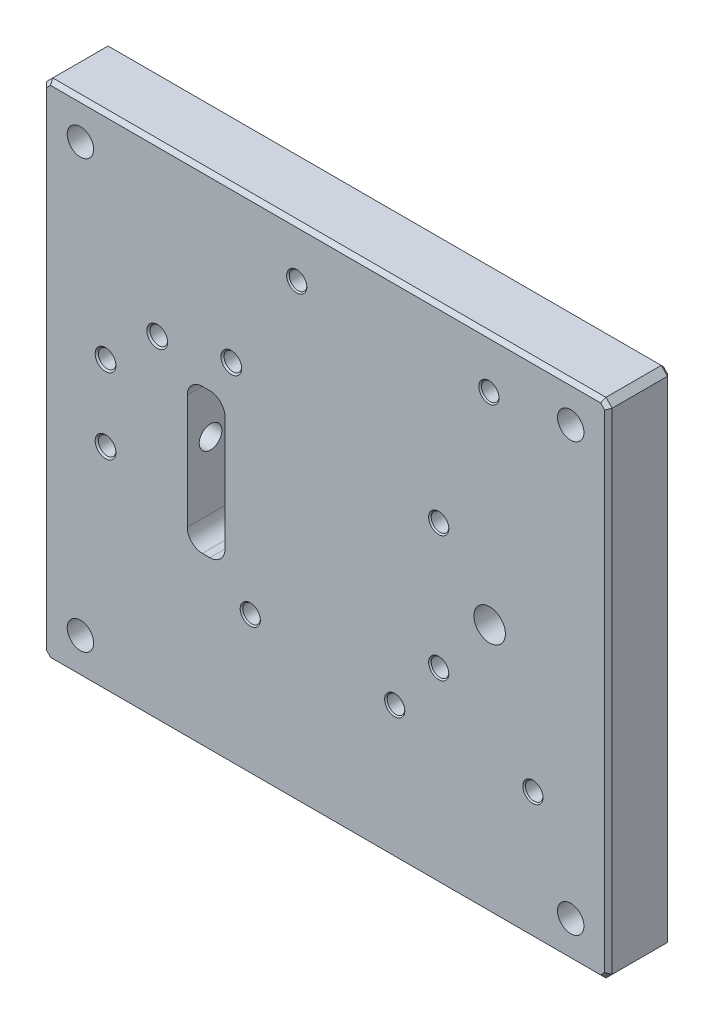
from build123d import *

# Parameters (mm, degrees)
ESQUISSE1_R                                  = 10.5
VOLUME_DEPTH                                 = 50
TROUS_TARAUD_S_M16_PONCTUELLES_D             = 14
TROUS_TARAUD_S_M16_PONCTUELLES_DEPTH         = 35
TROUS_TARAUD_S_M16_PONCTUELLES_CSINK_D       = 16.05
TROUS_TARAUD_S_M16_PONCTUELLES_CSINK_ANGLE   = 90
TROUS_TARAUD_S_M16_PONCTUELLES_TIP           = 4.206024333
ESQUISSE25_R                                 = 12.5
CIMBLOT_LAMAGE_DEPTH                         = 18
LOGEMENT_PALONNIER_DEPTH                     = 38
AXE_PALONNIER_PER_AGE_17_5_D                 = 17.5
AXE_PALONNIER_PER_AGE_17_5_DEPTH             = 170
AXE_PALONNIER_PER_AGE_17_5_TIP               = 5.257530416
AXE_PLONNIER_AL_SAGE_18_DEPTH                = 495.974746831
AXE_PLONNIER_AL_SAGE_18_DEPTH_BACK           = 40
AXE_PLONNIER_AL_SAGE_18_START                = -145
ESQUISSE15_R                                 = 9
TARAUDAGES_M16_PR_POSITIONNEUR_D             = 14
TARAUDAGES_M16_PR_POSITIONNEUR_DEPTH         = 42
TARAUDAGES_M16_PR_POSITIONNEUR_CSINK_D       = 16.05
TARAUDAGES_M16_PR_POSITIONNEUR_CSINK_ANGLE   = 90
TARAUDAGES_M16_PR_POSITIONNEUR_TIP           = 4.206024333
TROUS_TARAUD_S_M16_BRIDES_D                  = 14
TROUS_TARAUD_S_M16_BRIDES_DEPTH              = 42
TROUS_TARAUD_S_M16_BRIDES_CSINK_D            = 16.05
TROUS_TARAUD_S_M16_BRIDES_CSINK_ANGLE        = 90
TROUS_TARAUD_S_M16_BRIDES_TIP                = 4.206024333
TROU_TARAUD_M16_SUPPORTS_SERRAGE_D           = 14
TROU_TARAUD_M16_SUPPORTS_SERRAGE_DEPTH       = 40
TROU_TARAUD_M16_SUPPORTS_SERRAGE_CSINK_D     = 16.5
TROU_TARAUD_M16_SUPPORTS_SERRAGE_CSINK_ANGLE = 90
TROU_TARAUD_M16_SUPPORTS_SERRAGE_TIP         = 4.206024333
CHANFREIN1_SIZE                              = 3


with BuildPart() as part:
    # Esquisse1 → Volume (new body)
    with BuildSketch(Plane(origin=(0, -20, 0), x_dir=(1, 0, 0), z_dir=(0, 0, -1))):
        Polygon((-280, -215), (-275, -220), (165, -220), (170, -215), (170, 175), (165, 180), (-275, 180), (-280, 175), align=None)
        with Locations((-250, 150)):
            Circle(ESQUISSE1_R, mode=Mode.SUBTRACT)
        with Locations((140, 150)):
            Circle(ESQUISSE1_R, mode=Mode.SUBTRACT)
        with Locations((-250, -190)):
            Circle(ESQUISSE1_R, mode=Mode.SUBTRACT)
        with Locations((140, -190)):
            Circle(ESQUISSE1_R, mode=Mode.SUBTRACT)
    extrude(amount=VOLUME_DEPTH)

    # Trous taraud_s M16 ponctuelles
    with Locations(Plane(origin=(35, 50, 0), x_dir=(1, 0, 0), z_dir=(0, 0, 1))):
        with Locations((0, 0), (0, -100)):
            CounterSinkHole(TROUS_TARAUD_S_M16_PONCTUELLES_D / 2, TROUS_TARAUD_S_M16_PONCTUELLES_CSINK_D / 2, depth=TROUS_TARAUD_S_M16_PONCTUELLES_DEPTH, counter_sink_angle=TROUS_TARAUD_S_M16_PONCTUELLES_CSINK_ANGLE)
            with Locations((0, 0, -(TROUS_TARAUD_S_M16_PONCTUELLES_DEPTH + TROUS_TARAUD_S_M16_PONCTUELLES_TIP / 2))):  # 118° drill point
                Cone(0, TROUS_TARAUD_S_M16_PONCTUELLES_D / 2, TROUS_TARAUD_S_M16_PONCTUELLES_TIP, mode=Mode.SUBTRACT)

    # Esquisse23 → Cimblot - Chambrage vis M16 (revolve, cut)
    with BuildSketch(Plane(origin=(75.502, 0, -50), x_dir=(0, 1, 0), z_dir=(1, 0, 0))):
        Polygon((0, 0), (0, 50), (9, 50), (8.75, 49.75), (8.75, 16), (13, 16), (13, 0.75), (13.75, 0), align=None)
    revolve(axis=Axis((75.502, 0, -56.35), (0, 0, 1)), mode=Mode.SUBTRACT)

    # Esquisse25 → Cimblot - Lamage (cut)
    with BuildSketch(Plane.XY):
        with Locations((75.502, 0)):
            Circle(ESQUISSE25_R)
    extrude(amount=-CIMBLOT_LAMAGE_DEPTH, mode=Mode.SUBTRACT)

    # Esquisse18 → Logement palonnier (cut)
    with BuildSketch(Plane.XY):
        with BuildLine():
            Line((-153, 50), (-147, 50))
            ThreePointArc((-147, 50), (-138.514718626, 46.485281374), (-135, 38))
            Line((-135, 38), (-135, -53))
            ThreePointArc((-135, -53), (-138.514718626, -61.485281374), (-147, -65))
            Line((-147, -65), (-153, -65))
            ThreePointArc((-153, -65), (-161.485281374, -61.485281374), (-165, -53))
            Line((-165, -53), (-165, 38))
            ThreePointArc((-165, 38), (-161.485281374, 46.485281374), (-153, 50))
        make_face()
    extrude(amount=-LOGEMENT_PALONNIER_DEPTH, mode=Mode.SUBTRACT)

    # Axe palonnier per_age _17.5
    with Locations(Plane(origin=(-280, 0, -18.5), x_dir=(0, -1, 0), z_dir=(-1, 0, 0))):
        with Locations((0, 0)):
            Hole(AXE_PALONNIER_PER_AGE_17_5_D / 2, depth=AXE_PALONNIER_PER_AGE_17_5_DEPTH)
            with Locations((0, 0, -(AXE_PALONNIER_PER_AGE_17_5_DEPTH + AXE_PALONNIER_PER_AGE_17_5_TIP / 2))):  # 118° drill point
                Cone(0, AXE_PALONNIER_PER_AGE_17_5_D / 2, AXE_PALONNIER_PER_AGE_17_5_TIP, mode=Mode.SUBTRACT)

    # Esquisse15 → Axe plonnier al_sage _18 (cut, two sides: drawn at the far end of the back side and taken through both)
    with BuildSketch(Plane.ZY.offset(280).offset(AXE_PLONNIER_AL_SAGE_18_START - AXE_PLONNIER_AL_SAGE_18_DEPTH_BACK)):
        with Locations(Location((-18.5, 0, 0), (0, 0, 180))):
            Circle(ESQUISSE15_R)
    extrude(amount=AXE_PLONNIER_AL_SAGE_18_DEPTH + AXE_PLONNIER_AL_SAGE_18_DEPTH_BACK, mode=Mode.SUBTRACT)

    # Taraudages M16 pr_-positionneur
    with Locations(Plane(origin=(-114.891252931, -88, 0), x_dir=(1, 0, 0), z_dir=(0, 0, 1))):
        with Locations((0, 0), (114.891252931, -5), (224.787233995, -9.782608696)):
            CounterSinkHole(TARAUDAGES_M16_PR_POSITIONNEUR_D / 2, TARAUDAGES_M16_PR_POSITIONNEUR_CSINK_D / 2, depth=TARAUDAGES_M16_PR_POSITIONNEUR_DEPTH, counter_sink_angle=TARAUDAGES_M16_PR_POSITIONNEUR_CSINK_ANGLE)
            with Locations((0, 0, -(TARAUDAGES_M16_PR_POSITIONNEUR_DEPTH + TARAUDAGES_M16_PR_POSITIONNEUR_TIP / 2))):  # 118° drill point
                Cone(0, TARAUDAGES_M16_PR_POSITIONNEUR_D / 2, TARAUDAGES_M16_PR_POSITIONNEUR_TIP, mode=Mode.SUBTRACT)

    # Trous taraud_s M16 - brides
    with Locations(Plane(origin=(-77.926241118, 160, 0), x_dir=(1, 0, 0), z_dir=(0, 0, 1))):
        with Locations((0, 0), (152.855319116, 0)):
            CounterSinkHole(TROUS_TARAUD_S_M16_BRIDES_D / 2, TROUS_TARAUD_S_M16_BRIDES_CSINK_D / 2, depth=TROUS_TARAUD_S_M16_BRIDES_DEPTH, counter_sink_angle=TROUS_TARAUD_S_M16_BRIDES_CSINK_ANGLE)
            with Locations((0, 0, -(TROUS_TARAUD_S_M16_BRIDES_DEPTH + TROUS_TARAUD_S_M16_BRIDES_TIP / 2))):  # 118° drill point
                Cone(0, TROUS_TARAUD_S_M16_BRIDES_D / 2, TROUS_TARAUD_S_M16_BRIDES_TIP, mode=Mode.SUBTRACT)

    # Trou taraud_ M16 - Supports serrage
    with Locations(Plane.XY):
        with Locations((-230, 30), (-130, 78), (-188.891628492, 66.520623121), (-230, -30)):
            CounterSinkHole(TROU_TARAUD_M16_SUPPORTS_SERRAGE_D / 2, TROU_TARAUD_M16_SUPPORTS_SERRAGE_CSINK_D / 2, depth=TROU_TARAUD_M16_SUPPORTS_SERRAGE_DEPTH, counter_sink_angle=TROU_TARAUD_M16_SUPPORTS_SERRAGE_CSINK_ANGLE)
            with Locations((0, 0, -(TROU_TARAUD_M16_SUPPORTS_SERRAGE_DEPTH + TROU_TARAUD_M16_SUPPORTS_SERRAGE_TIP / 2))):  # 118° drill point
                Cone(0, TROU_TARAUD_M16_SUPPORTS_SERRAGE_D / 2, TROU_TARAUD_M16_SUPPORTS_SERRAGE_TIP, mode=Mode.SUBTRACT)

    # Chanfrein1
    chanfrein1_edges = [part.edges().sort_by_distance(p)[0] for p in [
        (-55, 200, -50),
        (-277.5, 197.5, 0),
        (-280, 0, 0),
        (167.5, 197.5, -50),
        (170, 0, -50),
        (167.5, -197.5, -50),
        (-55, -200, -50),
        (-277.5, -197.5, -50),
        (-280, 0, -50),
        (-277.5, 197.5, -50),
        (-277.5, -197.5, 0),
        (-55, -200, 0),
        (167.5, -197.5, 0),
        (170, 0, 0),
        (167.5, 197.5, 0),
        (-55, 200, 0),
    ]]
    chamfer(chanfrein1_edges, length=CHANFREIN1_SIZE)


solid = part.part
